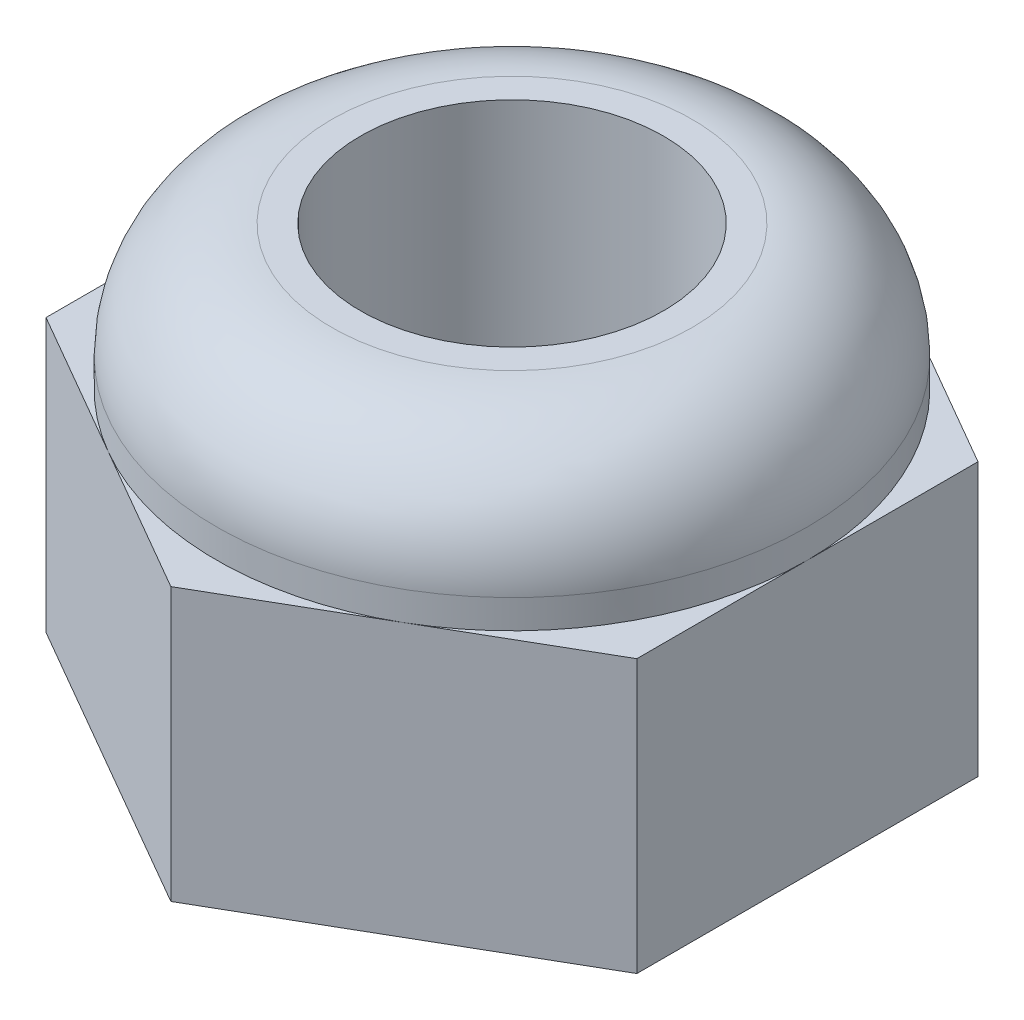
from build123d import *

# Parameters (mm, degrees)
BOSS_EXTRU_1_DEPTH      = 1.8
ESQUISSE3_R             = 1
ENL_V_MAT_EXTRU_1_DEPTH = 5.05401036


with BuildPart() as part:
    # Esquisse1 → Boss.-Extru.1 (new body)
    with BuildSketch(Plane(origin=(0, 0, 0), x_dir=(1, 0, 0), z_dir=(0, 1, 0))):
        Polygon((1.95, -1.125833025), (1.95, 1.125833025), (0, 2.25166605), (-1.95, 1.125833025), (-1.95, -1.125833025), (0, -2.25166605), align=None)
    extrude(amount=BOSS_EXTRU_1_DEPTH)

    # Esquisse2 → R_volution1 (revolve)
    with BuildSketch(Plane.XY, mode=Mode.PRIVATE) as r_volution1_sk:
        with BuildLine():
            Line((-1.95, 1.8), (0, 1.8))
            Line((0, 1.8), (0, 2.75))
            Line((0, 2.75), (-1.19, 2.75))
            ThreePointArc((-1.19, 2.75), (-1.727401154, 2.527401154), (-1.95, 1.99))
            Line((-1.95, 1.99), (-1.95, 1.8))
        make_face()
    revolve(r_volution1_sk.sketch.rotate(Axis((0, 1.8, 0), (0, 1, 0)), 180), axis=Axis((0, 1.8, 0), (0, 1, 0)))

    # Esquisse3 → Enl_v. mat.-Extru.1 (cut, through all)
    with BuildSketch(Plane.XZ):
        with Locations(Location((0, 0, 0), (0, 0, 270))):
            Circle(ESQUISSE3_R)
    extrude(amount=-ENL_V_MAT_EXTRU_1_DEPTH, mode=Mode.SUBTRACT)


solid = part.part
